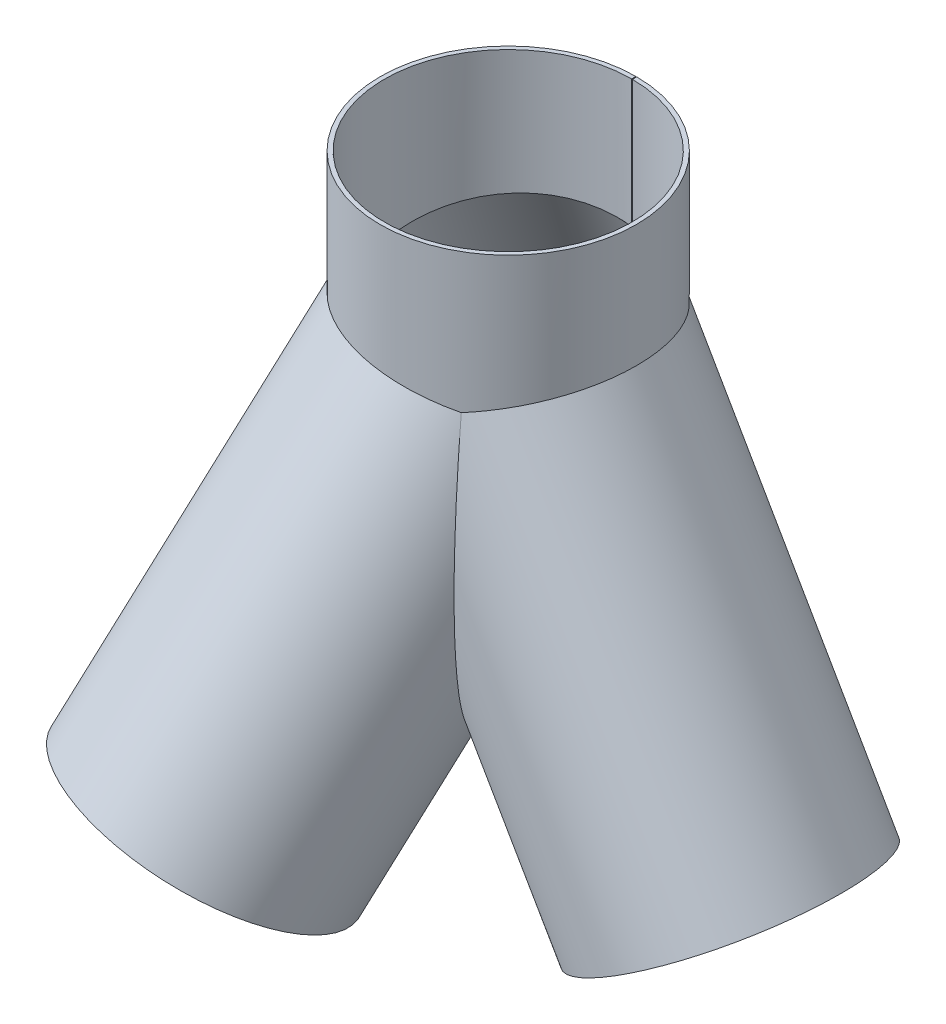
from build123d import *

# Parameters (mm, degrees)
SKETCH_2_R                = 180
SKETCH_2_R_2              = 174
EXTRUDE_1_DEPTH           = 220
SKETCH_3_R                = 180
SKETCH_3_R_2              = 174
EXTRUDE_2_DEPTH           = 623.538291
CUT_EXTRUDE_1_DEPTH       = 805.9844719
CUT_EXTRUDE_1_DEPTH_BACK  = 805.9844719
CUT_EXTRUDE_14_DEPTH      = 805.9844719
CUT_EXTRUDE_14_DEPTH_BACK = 805.9844719
CUT_EXTRUDE_10_DEPTH      = 805.9844719
CUT_EXTRUDE_10_DEPTH_BACK = 805.9844719
CUT_EXTRUDE_13_DEPTH      = 805.9844719
CUT_EXTRUDE_13_DEPTH_BACK = 805.9844719
CUT_EXTRUDE_12_DEPTH      = 805.9844719
CUT_EXTRUDE_12_DEPTH_BACK = 805.9844719
CUT_EXTRUDE_11_DEPTH      = 805.9844719
CUT_EXTRUDE_11_DEPTH_BACK = 805.9844719
SKETCH_1_W                = 1
SKETCH_1_H                = 760
CUT_EXTRUDE_1_2_DEPTH     = 805.9844719
SKETCH_10_W               = 180
SKETCH_10_H               = 1
CUT_EXTRUDE_2_DEPTH       = 923.950102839
PATTERN_CIRCULAR_1_COUNT  = 3


with BuildPart() as part:
    # Sketch 2 → Extrude 1 (new body)
    with BuildSketch(Plane(origin=(0, 0, 0), x_dir=(1, 0, 0), z_dir=(0, 1, 0))):
        Circle(SKETCH_2_R)
        Circle(SKETCH_2_R_2, mode=Mode.SUBTRACT)
    extrude(amount=EXTRUDE_1_DEPTH)

    # Sketch 4 → Cut-Extrude 1 (cut, two sides: drawn at the far end of the back side and taken through both)
    with BuildSketch(Plane.XY.offset(-CUT_EXTRUDE_1_DEPTH_BACK)):
        Polygon((1871.491935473, 501.464752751), (180, 48.230854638), (-180, -48.230854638), (-1871.491935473, -501.464752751), (-965.024139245, -3884.448623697), (2777.9597317, -2881.519118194), align=None)
    extrude(amount=CUT_EXTRUDE_1_DEPTH + CUT_EXTRUDE_1_DEPTH_BACK, mode=Mode.SUBTRACT)

    # Sketch 6 → Cut-Extrude 12 (cut, two sides: drawn at the far end of the back side and taken through both)
    with BuildSketch(Plane(origin=(0, 0, 0), x_dir=(-0.4999999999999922, 0, -0.8660254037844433), z_dir=(0.8660254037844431, 0, -0.4999999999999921)).offset(-CUT_EXTRUDE_12_DEPTH_BACK)):
        Polygon((1900.813375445, 509.321408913), (180, 48.230854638), (-180, -48.230854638), (-1900.813375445, -509.321408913), (-978.632266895, -3950.948159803), (2822.994483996, -2932.305341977), align=None)
    extrude(amount=CUT_EXTRUDE_12_DEPTH + CUT_EXTRUDE_12_DEPTH_BACK, mode=Mode.SUBTRACT)

    # Sketch 7 → Cut-Extrude 11 (cut, two sides: drawn at the far end of the back side and taken through both)
    with BuildSketch(Plane(origin=(0, 0, 0), x_dir=(-0.5000000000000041, 0, 0.8660254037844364), z_dir=(-0.8660254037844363, 0, -0.500000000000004)).offset(-CUT_EXTRUDE_11_DEPTH_BACK)):
        Polygon((1900.813375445, 509.321408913), (180, 48.230854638), (-180, -48.230854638), (-1900.813375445, -509.321408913), (-978.632266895, -3950.948159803), (2822.994483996, -2932.305341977), align=None)
    extrude(amount=CUT_EXTRUDE_11_DEPTH + CUT_EXTRUDE_11_DEPTH_BACK, mode=Mode.SUBTRACT)

    # Sketch 1 → Cut-Extrude 1 2 (cut, through all)
    with BuildSketch(Plane.XY):
        with Locations((0, -160)):
            Rectangle(SKETCH_1_W, SKETCH_1_H)
    extrude(amount=-CUT_EXTRUDE_1_2_DEPTH, mode=Mode.SUBTRACT)


with BuildPart() as body_2:
    # Sketch 3 → Extrude 2 (new body)
    with BuildSketch(Plane(origin=(311.769145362, -540, 0), x_dir=(0.8660254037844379, 0.5000000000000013, 0), z_dir=(0.5000000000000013, -0.8660254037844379, 0))):
        Circle(SKETCH_3_R)
        Circle(SKETCH_3_R_2, mode=Mode.SUBTRACT)
    extrude(amount=-EXTRUDE_2_DEPTH)

    # Sketch 4_3 → Cut-Extrude 14 (cut, two sides: drawn at the far end of the back side and taken through both)
    with BuildSketch(Plane.XY.offset(-CUT_EXTRUDE_14_DEPTH_BACK)):
        Polygon((1871.491935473, 501.464752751), (180, 48.230854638), (-180, -48.230854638), (-1871.491935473, -501.464752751), (-2777.9597317, 2881.519118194), (965.024139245, 3884.448623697), align=None)
    extrude(amount=CUT_EXTRUDE_14_DEPTH + CUT_EXTRUDE_14_DEPTH_BACK, mode=Mode.SUBTRACT)

    # Sketch 8 → Cut-Extrude 10 (cut, two sides: drawn at the far end of the back side and taken through both)
    with BuildSketch(Plane(origin=(0, 0, 0), x_dir=(-0.8660254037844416, 0, 0.49999999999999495), z_dir=(-0.49999999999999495, 0, -0.8660254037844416)).offset(-CUT_EXTRUDE_10_DEPTH_BACK)):
        Polygon((0, 2197.256973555), (0, 220), (0, -540), (0, -2517.256973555), (3954.51394711, -2517.256973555), (3954.51394711, 2197.256973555), align=None)
    extrude(amount=CUT_EXTRUDE_10_DEPTH + CUT_EXTRUDE_10_DEPTH_BACK, mode=Mode.SUBTRACT)

    # Sketch 9 → Cut-Extrude 13 (cut, two sides: drawn at the far end of the back side and taken through both)
    with BuildSketch(Plane(origin=(0, 0, 0), x_dir=(-0.8660254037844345, 0, -0.5000000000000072), z_dir=(0.5000000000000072, 0, -0.8660254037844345)).offset(-CUT_EXTRUDE_13_DEPTH_BACK)):
        Polygon((0, -2517.256973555), (0, -540), (0, 220), (0, 2197.256973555), (3954.51394711, 2197.256973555), (3954.51394711, -2517.256973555), align=None)
    extrude(amount=CUT_EXTRUDE_13_DEPTH + CUT_EXTRUDE_13_DEPTH_BACK, mode=Mode.SUBTRACT)

    # Sketch 10 → Cut-Extrude 2 (cut, through all)
    with BuildSketch(Plane(origin=(311.769145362, -540, 0), x_dir=(0.8660254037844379, 0.5000000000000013, 0), z_dir=(0.5000000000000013, -0.8660254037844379, 0))):
        with Locations((-90, 0)):
            Rectangle(SKETCH_10_W, SKETCH_10_H)
    extrude(amount=-CUT_EXTRUDE_2_DEPTH, mode=Mode.SUBTRACT)


with BuildPart() as pattern_circular_1_1:
    # Pattern Circular 1: pattern copy
    add(body_2.part.rotate(Axis((0, 0, 0), (0, 1, 0)), 1 * 360 / PATTERN_CIRCULAR_1_COUNT))


with BuildPart() as pattern_circular_1_2:
    # Pattern Circular 1: pattern copy
    add(body_2.part.rotate(Axis((0, 0, 0), (0, 1, 0)), 2 * 360 / PATTERN_CIRCULAR_1_COUNT))


solid = Compound([part.part, body_2.part, pattern_circular_1_1.part, pattern_circular_1_2.part])
